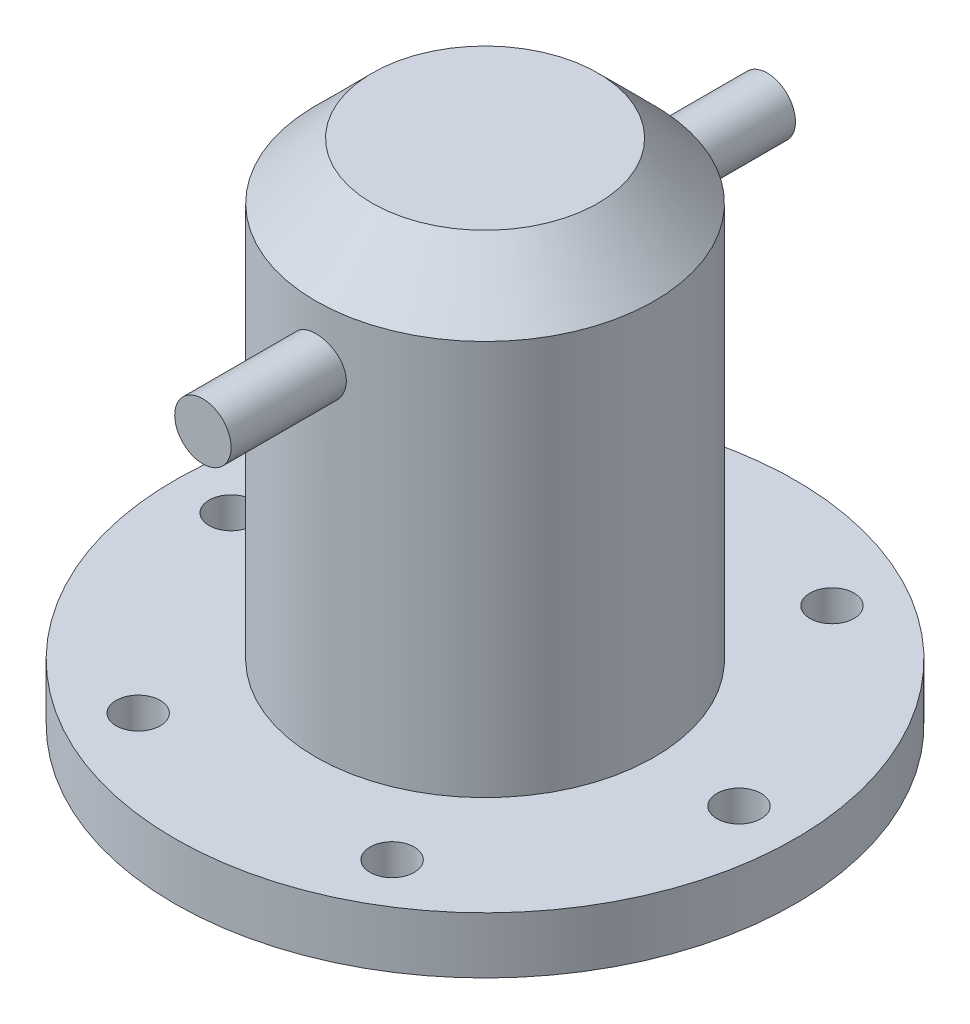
ISO-10303-21;
HEADER;
FILE_DESCRIPTION(('STEP AP214'),'2;1');
FILE_NAME('part.step','',(''),(''),'','','');
FILE_SCHEMA(('AUTOMOTIVE_DESIGN { 1 0 10303 214 1 1 1 1 }'));
ENDSEC;
DATA;
#1=APPLICATION_CONTEXT('core data for automotive mechanical design processes');
#2=APPLICATION_PROTOCOL_DEFINITION('international standard','automotive_design',2000,#1);
#3=PRODUCT_CONTEXT('',#1,'mechanical');
#4=PRODUCT('Part','Part','',(#3));
#5=PRODUCT_RELATED_PRODUCT_CATEGORY('part','',(#4));
#6=PRODUCT_DEFINITION_FORMATION('','',#4);
#7=PRODUCT_DEFINITION_CONTEXT('part definition',#1,'design');
#8=PRODUCT_DEFINITION('design','',#6,#7);
#9=PRODUCT_DEFINITION_SHAPE('','',#8);
#10=(LENGTH_UNIT() NAMED_UNIT(*) SI_UNIT(.MILLI.,.METRE.));
#11=(NAMED_UNIT(*) PLANE_ANGLE_UNIT() SI_UNIT($,.RADIAN.));
#12=(NAMED_UNIT(*) SI_UNIT($,.STERADIAN.) SOLID_ANGLE_UNIT());
#13=UNCERTAINTY_MEASURE_WITH_UNIT(LENGTH_MEASURE(1.E-05),#10,'distance_accuracy_value','');
#14=(GEOMETRIC_REPRESENTATION_CONTEXT(3) GLOBAL_UNCERTAINTY_ASSIGNED_CONTEXT((#13)) GLOBAL_UNIT_ASSIGNED_CONTEXT((#10,
#11,#12)) REPRESENTATION_CONTEXT('',''));
#15=CARTESIAN_POINT('',(0.,0.,0.));
#16=DIRECTION('',(0.,0.,1.));
#17=DIRECTION('',(1.,0.,0.));
#18=AXIS2_PLACEMENT_3D('',#15,#16,#17);
#19=CARTESIAN_POINT('',(0.,0.,0.));
#20=DIRECTION('',(0.,1.,0.));
#21=DIRECTION('',(0.,0.,1.));
#22=AXIS2_PLACEMENT_3D('',#19,#20,#21);
#23=CYLINDRICAL_SURFACE('',#22,38.1);
#24=CARTESIAN_POINT('',(-6.35,88.9,-37.5671066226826));
#25=CARTESIAN_POINT('',(-6.35000273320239,89.0770679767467,-37.5671053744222));
#26=CARTESIAN_POINT('',(-6.34259145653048,89.254099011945,-37.5683609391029));
#27=CARTESIAN_POINT('',(-6.31300769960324,89.6069429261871,-37.5733439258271));
#28=CARTESIAN_POINT('',(-6.29083229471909,89.7827555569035,-37.5770718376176));
#29=CARTESIAN_POINT('',(-6.2318672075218,90.1319541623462,-37.5868955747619));
#30=CARTESIAN_POINT('',(-6.19506827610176,90.3053385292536,-37.5929928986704));
#31=CARTESIAN_POINT('',(-6.10712272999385,90.6484047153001,-37.6073800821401));
#32=CARTESIAN_POINT('',(-6.05597084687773,90.8180851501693,-37.61567074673));
#33=CARTESIAN_POINT('',(-5.93978072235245,91.1522798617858,-37.6341926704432));
#34=CARTESIAN_POINT('',(-5.87475944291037,91.3168001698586,-37.6444215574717));
#35=CARTESIAN_POINT('',(-5.73124544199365,91.6398121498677,-37.6665381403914));
#36=CARTESIAN_POINT('',(-5.65274775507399,91.7983015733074,-37.6784264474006));
#37=CARTESIAN_POINT('',(-5.48290450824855,92.1080270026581,-37.7035160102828));
#38=CARTESIAN_POINT('',(-5.39156532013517,92.2592665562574,-37.7167166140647));
#39=CARTESIAN_POINT('',(-5.19661640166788,92.5536078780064,-37.7440706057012));
#40=CARTESIAN_POINT('',(-5.09300210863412,92.6967065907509,-37.7582243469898));
#41=CARTESIAN_POINT('',(-4.87331964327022,92.974915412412,-37.7872085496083));
#42=CARTESIAN_POINT('',(-4.75715354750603,93.109947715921,-37.8020437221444));
#43=CARTESIAN_POINT('',(-4.51385687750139,93.3698198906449,-37.8318664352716));
#44=CARTESIAN_POINT('',(-4.38672225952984,93.4946559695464,-37.846854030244));
#45=CARTESIAN_POINT('',(-4.1224382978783,93.733185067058,-37.8765517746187));
#46=CARTESIAN_POINT('',(-3.985292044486,93.8468814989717,-37.8912620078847));
#47=CARTESIAN_POINT('',(-3.7018362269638,94.0624240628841,-37.9200040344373));
#48=CARTESIAN_POINT('',(-3.55552330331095,94.1642658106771,-37.9340355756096));
#49=CARTESIAN_POINT('',(-3.25393610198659,94.3558677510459,-37.9610977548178));
#50=CARTESIAN_POINT('',(-3.09861610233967,94.4455568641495,-37.9741223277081));
#51=CARTESIAN_POINT('',(-2.78079967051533,94.6115506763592,-37.9987180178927));
#52=CARTESIAN_POINT('',(-2.61830058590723,94.6878503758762,-38.0102885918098));
#53=CARTESIAN_POINT('',(-2.28738093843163,94.826426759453,-38.0316359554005));
#54=CARTESIAN_POINT('',(-2.11896289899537,94.8887093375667,-38.0414134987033));
#55=CARTESIAN_POINT('',(-1.77734849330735,94.9988362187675,-38.0589068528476));
#56=CARTESIAN_POINT('',(-1.60415040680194,95.0466752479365,-38.0666219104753));
#57=CARTESIAN_POINT('',(-1.08260706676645,95.16710833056,-38.0861859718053));
#58=CARTESIAN_POINT('',(-0.728853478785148,95.2180612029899,-38.0946836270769));
#59=CARTESIAN_POINT('',(-0.0179171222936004,95.2599644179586,-38.101657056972));
#60=CARTESIAN_POINT('',(0.339265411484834,95.2509188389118,-38.1001335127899));
#61=CARTESIAN_POINT('',(1.04342326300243,95.173588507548,-38.0873207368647));
#62=CARTESIAN_POINT('',(1.39046463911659,95.1058913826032,-38.0761283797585));
#63=CARTESIAN_POINT('',(2.06817845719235,94.914083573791,-38.0453389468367));
#64=CARTESIAN_POINT('',(2.39885040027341,94.7899711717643,-38.0257416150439));
#65=CARTESIAN_POINT('',(3.03620358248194,94.4882774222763,-37.9801804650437));
#66=CARTESIAN_POINT('',(3.34276805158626,94.3104538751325,-37.9541879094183));
#67=CARTESIAN_POINT('',(3.92192672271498,93.9065615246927,-37.8987237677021));
#68=CARTESIAN_POINT('',(4.19451817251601,93.6804888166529,-37.8692519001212));
#69=CARTESIAN_POINT('',(4.70146695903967,93.1832558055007,-37.8096848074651));
#70=CARTESIAN_POINT('',(4.93532031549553,92.911581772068,-37.7795863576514));
#71=CARTESIAN_POINT('',(5.35420467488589,92.3325887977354,-37.7225041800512));
#72=CARTESIAN_POINT('',(5.53923522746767,92.0252695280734,-37.6955204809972));
#73=CARTESIAN_POINT('',(5.85532085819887,91.3831252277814,-37.6477213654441));
#74=CARTESIAN_POINT('',(5.98631524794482,91.0482697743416,-37.6269128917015));
#75=CARTESIAN_POINT('',(6.190055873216,90.3608833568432,-37.5939351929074));
#76=CARTESIAN_POINT('',(6.26280723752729,90.0083539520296,-37.5817652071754));
#77=CARTESIAN_POINT('',(6.34728698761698,89.3001359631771,-37.5675895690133));
#78=CARTESIAN_POINT('',(6.35973380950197,88.9445353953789,-37.5654642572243));
#79=CARTESIAN_POINT('',(6.32516566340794,88.2363318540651,-37.5712998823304));
#80=CARTESIAN_POINT('',(6.27815299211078,87.8837287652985,-37.5792604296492));
#81=CARTESIAN_POINT('',(6.12661293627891,87.1938114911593,-37.604260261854));
#82=CARTESIAN_POINT('',(6.02245124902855,86.8564147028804,-37.6212417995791));
#83=CARTESIAN_POINT('',(5.7599533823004,86.2038657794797,-37.6623217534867));
#84=CARTESIAN_POINT('',(5.60161396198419,85.8887149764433,-37.6864205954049));
#85=CARTESIAN_POINT('',(5.23356002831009,85.286406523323,-37.7392978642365));
#86=CARTESIAN_POINT('',(5.02338512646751,84.9995338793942,-37.7681174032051));
#87=CARTESIAN_POINT('',(4.5582569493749,84.4648716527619,-37.8270685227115));
#88=CARTESIAN_POINT('',(4.30330052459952,84.2170848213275,-37.8572001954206));
#89=CARTESIAN_POINT('',(3.75266840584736,83.7650040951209,-37.9157591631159));
#90=CARTESIAN_POINT('',(3.45659681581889,83.5611893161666,-37.9441654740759));
#91=CARTESIAN_POINT('',(2.83398420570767,83.2061958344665,-37.9957357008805));
#92=CARTESIAN_POINT('',(2.5074441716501,83.0550154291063,-38.018899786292));
#93=CARTESIAN_POINT('',(1.83465502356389,82.8103217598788,-38.0572868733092));
#94=CARTESIAN_POINT('',(1.48849890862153,82.71655779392,-38.0725443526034));
#95=CARTESIAN_POINT('',(0.784880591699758,82.5885734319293,-38.0935356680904));
#96=CARTESIAN_POINT('',(0.427419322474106,82.5543481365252,-38.0992702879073));
#97=CARTESIAN_POINT('',(-0.106745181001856,82.548426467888,-38.1002647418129));
#98=CARTESIAN_POINT('',(-0.283476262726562,82.5538668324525,-38.0993542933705));
#99=CARTESIAN_POINT('',(-0.635823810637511,82.5794490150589,-38.0951001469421));
#100=CARTESIAN_POINT('',(-0.811440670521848,82.5995853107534,-38.0917573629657));
#101=CARTESIAN_POINT('',(-1.16037482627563,82.6544215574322,-38.0827261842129));
#102=CARTESIAN_POINT('',(-1.3336912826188,82.6891266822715,-38.077036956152));
#103=CARTESIAN_POINT('',(-1.67668986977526,82.7728181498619,-38.0634752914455));
#104=CARTESIAN_POINT('',(-1.84637328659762,82.8217993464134,-38.0556036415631));
#105=CARTESIAN_POINT('',(-2.18085097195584,82.9336390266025,-38.0379011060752));
#106=CARTESIAN_POINT('',(-2.34564888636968,82.9964868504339,-38.0280717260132));
#107=CARTESIAN_POINT('',(-2.66929808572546,83.1355953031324,-38.0067249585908));
#108=CARTESIAN_POINT('',(-2.82815147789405,83.2118511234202,-37.9952081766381));
#109=CARTESIAN_POINT('',(-3.13895355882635,83.3772765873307,-37.9707951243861));
#110=CARTESIAN_POINT('',(-3.29089952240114,83.4664512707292,-37.9578983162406));
#111=CARTESIAN_POINT('',(-3.58674415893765,83.6570316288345,-37.9310865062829));
#112=CARTESIAN_POINT('',(-3.73064563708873,83.7584330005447,-37.9171718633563));
#113=CARTESIAN_POINT('',(-4.01114809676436,83.974063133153,-37.8885313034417));
#114=CARTESIAN_POINT('',(-4.14764257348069,84.0884294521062,-37.8737977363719));
#115=CARTESIAN_POINT('',(-4.41048688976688,84.328158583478,-37.8440893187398));
#116=CARTESIAN_POINT('',(-4.53684033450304,84.4535174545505,-37.8291145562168));
#117=CARTESIAN_POINT('',(-4.77866436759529,84.7144855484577,-37.7993283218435));
#118=CARTESIAN_POINT('',(-4.8941283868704,84.8501008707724,-37.784516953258));
#119=CARTESIAN_POINT('',(-5.11324724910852,85.1305364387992,-37.7554885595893));
#120=CARTESIAN_POINT('',(-5.21690643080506,85.2753532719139,-37.7412713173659));
#121=CARTESIAN_POINT('',(-5.41246463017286,85.5743609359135,-37.7137250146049));
#122=CARTESIAN_POINT('',(-5.50427005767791,85.7286136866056,-37.700403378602));
#123=CARTESIAN_POINT('',(-5.67450568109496,86.0443660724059,-37.6751561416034));
#124=CARTESIAN_POINT('',(-5.75294079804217,86.2058630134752,-37.6632300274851));
#125=CARTESIAN_POINT('',(-5.89584528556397,86.5349094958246,-37.6411243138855));
#126=CARTESIAN_POINT('',(-5.96032438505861,86.7024547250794,-37.63094349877));
#127=CARTESIAN_POINT('',(-6.07488155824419,87.0424475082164,-37.6126198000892));
#128=CARTESIAN_POINT('',(-6.12496272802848,87.2148939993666,-37.6044764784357));
#129=CARTESIAN_POINT('',(-6.22810526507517,87.6359970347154,-37.5875581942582));
#130=CARTESIAN_POINT('',(-6.27376135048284,87.8865519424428,-37.5799262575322));
#131=CARTESIAN_POINT('',(-6.33470648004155,88.3914300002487,-37.5697014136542));
#132=CARTESIAN_POINT('',(-6.3499960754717,88.6457530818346,-37.5671084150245));
#133=CARTESIAN_POINT('',(-6.35,88.9,-37.5671066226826));
#134=B_SPLINE_CURVE_WITH_KNOTS('',3,(#24,#25,#26,#27,#28,#29,#30,#31,#32,#33,#34,#35,#36,#37,
#38,#39,#40,#41,#42,#43,#44,#45,#46,#47,#48,#49,#50,#51,#52,#53,#54,#55,#56,#57,#58,#59,#60,#61,
#62,#63,#64,#65,#66,#67,#68,#69,#70,#71,#72,#73,#74,#75,#76,#77,#78,#79,#80,#81,#82,#83,#84,#85,
#86,#87,#88,#89,#90,#91,#92,#93,#94,#95,#96,#97,#98,#99,#100,#101,#102,#103,#104,#105,#106,#107,
#108,#109,#110,#111,#112,#113,#114,#115,#116,#117,#118,#119,#120,#121,#122,#123,#124,#125,#126,
#127,#128,#129,#130,#131,#132,#133),.UNSPECIFIED.,.T.,.F.,(4,2,2,2,2,2,2,2,2,2,2,2,2,2,2,2,2,2,
2,2,2,2,2,2,2,2,2,2,2,2,2,2,2,2,2,2,2,2,2,2,2,2,2,2,2,2,2,2,2,2,2,2,2,2,4),(0.,
0.530980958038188,1.0620671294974,1.59348973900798,2.12510766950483,2.65607913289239,
3.18724665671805,3.71815154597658,4.2492543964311,4.78484935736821,5.32064262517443,
5.85627120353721,6.39209724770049,6.930933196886,7.46996992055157,8.00877955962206,
8.54778570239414,9.61467796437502,10.6814977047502,11.7377510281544,12.79403652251,
13.8551580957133,14.9163655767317,15.9904476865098,17.0645397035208,18.1398347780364,
19.215035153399,20.2773941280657,21.3397120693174,22.3953101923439,23.4509714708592,
24.516369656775,25.5818428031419,26.6583966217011,27.7349156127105,28.8066999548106,
29.8783960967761,30.408331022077,30.9380669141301,31.4679910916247,31.9977244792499,
32.5270520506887,33.0561901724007,33.5855352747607,34.11469462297,34.6501139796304,
35.1853421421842,35.720891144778,36.2562426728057,36.7955915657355,37.3347415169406,
37.8735144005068,38.4121713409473,39.1746057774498,39.9370263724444),.UNSPECIFIED.);
#135=CARTESIAN_POINT('',(-6.35,88.9,-37.5671066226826));
#136=VERTEX_POINT('',#135);
#137=EDGE_CURVE('E40',#136,#136,#134,.T.);
#138=ORIENTED_EDGE('',*,*,#137,.F.);
#139=EDGE_LOOP('',(#138));
#140=FACE_BOUND('',#139,.T.);
#141=CARTESIAN_POINT('',(0.,101.6,0.));
#142=DIRECTION('',(0.,1.,0.));
#143=DIRECTION('',(0.,0.,1.));
#144=AXIS2_PLACEMENT_3D('',#141,#142,#143);
#145=CIRCLE('',#144,38.1);
#146=CARTESIAN_POINT('',(0.,101.6,38.1));
#147=VERTEX_POINT('',#146);
#148=EDGE_CURVE('E93',#147,#147,#145,.T.);
#149=ORIENTED_EDGE('',*,*,#148,.F.);
#150=EDGE_LOOP('',(#149));
#151=FACE_BOUND('',#150,.T.);
#152=CARTESIAN_POINT('',(0.,12.7,0.));
#153=DIRECTION('',(0.,1.,0.));
#154=DIRECTION('',(0.,0.,1.));
#155=AXIS2_PLACEMENT_3D('',#152,#153,#154);
#156=CIRCLE('',#155,38.1);
#157=CARTESIAN_POINT('',(0.,12.7,38.1));
#158=VERTEX_POINT('',#157);
#159=EDGE_CURVE('E97',#158,#158,#156,.T.);
#160=ORIENTED_EDGE('',*,*,#159,.T.);
#161=EDGE_LOOP('',(#160));
#162=FACE_BOUND('',#161,.T.);
#163=CARTESIAN_POINT('',(0.,82.55,38.1));
#164=CARTESIAN_POINT('',(0.177087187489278,82.5499972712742,38.1000011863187));
#165=CARTESIAN_POINT('',(0.354137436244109,82.5574101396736,38.0987630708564));
#166=CARTESIAN_POINT('',(0.707020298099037,82.5870004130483,38.0938477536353));
#167=CARTESIAN_POINT('',(0.882852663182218,82.6091807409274,38.0901700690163));
#168=CARTESIAN_POINT('',(1.23209116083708,82.6681592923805,38.0804739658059));
#169=CARTESIAN_POINT('',(1.4054956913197,82.704966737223,38.0744540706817));
#170=CARTESIAN_POINT('',(1.74860263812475,82.7929332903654,38.0602401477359));
#171=CARTESIAN_POINT('',(1.91830367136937,82.8440976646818,38.0520453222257));
#172=CARTESIAN_POINT('',(2.2525422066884,82.9603179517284,38.0337223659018));
#173=CARTESIAN_POINT('',(2.41708564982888,83.0253571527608,38.0235965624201));
#174=CARTESIAN_POINT('',(2.74014193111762,83.168911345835,38.0016821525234));
#175=CARTESIAN_POINT('',(2.89865252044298,83.2474313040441,37.98989293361));
#176=CARTESIAN_POINT('',(3.20841653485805,83.4173225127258,37.9649864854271));
#177=CARTESIAN_POINT('',(3.35967352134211,83.5086873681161,37.9518699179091));
#178=CARTESIAN_POINT('',(3.65404496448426,83.703689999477,37.9246597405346));
#179=CARTESIAN_POINT('',(3.79715636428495,83.8073323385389,37.9105657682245));
#180=CARTESIAN_POINT('',(4.07534808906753,84.0270429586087,37.8816744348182));
#181=CARTESIAN_POINT('',(4.21035302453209,84.1432060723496,37.8668722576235));
#182=CARTESIAN_POINT('',(4.47017019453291,84.3864909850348,37.8370808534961));
#183=CARTESIAN_POINT('',(4.59497863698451,84.513616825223,37.822091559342));
#184=CARTESIAN_POINT('',(4.83345363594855,84.7778777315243,37.7923559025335));
#185=CARTESIAN_POINT('',(4.94712356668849,84.9150097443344,37.7776094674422));
#186=CARTESIAN_POINT('',(5.16261513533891,85.1984316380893,37.7487646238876));
#187=CARTESIAN_POINT('',(5.26443238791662,85.3447248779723,37.7346664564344));
#188=CARTESIAN_POINT('',(5.45600638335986,85.6462962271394,37.7074450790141));
#189=CARTESIAN_POINT('',(5.54568970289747,85.8016215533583,37.6943280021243));
#190=CARTESIAN_POINT('',(5.71167137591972,86.1194481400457,37.6695348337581));
#191=CARTESIAN_POINT('',(5.78796472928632,86.2819520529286,37.6578592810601));
#192=CARTESIAN_POINT('',(5.92652810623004,86.6128815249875,37.6363015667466));
#193=CARTESIAN_POINT('',(5.98880405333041,86.7813045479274,37.6264186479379));
#194=CARTESIAN_POINT('',(6.09891747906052,87.1229300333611,37.6087259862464));
#195=CARTESIAN_POINT('',(6.14674968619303,87.2961342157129,37.600917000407));
#196=CARTESIAN_POINT('',(6.26716384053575,87.8177078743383,37.581106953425));
#197=CARTESIAN_POINT('',(6.31810213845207,88.1714884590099,37.5724910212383));
#198=CARTESIAN_POINT('',(6.35996687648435,88.8824780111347,37.5654259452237));
#199=CARTESIAN_POINT('',(6.35089756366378,89.239686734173,37.5669760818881));
#200=CARTESIAN_POINT('',(6.27352869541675,89.9437424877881,37.5799723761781));
#201=CARTESIAN_POINT('',(6.20584069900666,90.2906583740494,37.5913163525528));
#202=CARTESIAN_POINT('',(6.01409427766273,90.9681259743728,37.6224668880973));
#203=CARTESIAN_POINT('',(5.89003391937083,91.2986771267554,37.6422737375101));
#204=CARTESIAN_POINT('',(5.58844985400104,91.9358801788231,37.6882274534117));
#205=CARTESIAN_POINT('',(5.41067212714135,92.2424096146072,37.7144043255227));
#206=CARTESIAN_POINT('',(5.0068786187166,92.8215174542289,37.7701281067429));
#207=CARTESIAN_POINT('',(4.78085894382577,93.0940931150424,37.7996752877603));
#208=CARTESIAN_POINT('',(4.28366479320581,93.6010981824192,37.8592595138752));
#209=CARTESIAN_POINT('',(4.01196546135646,93.83501301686,37.8892980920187));
#210=CARTESIAN_POINT('',(3.43289953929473,94.2540095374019,37.946142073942));
#211=CARTESIAN_POINT('',(3.12553271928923,94.4390909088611,37.9729474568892));
#212=CARTESIAN_POINT('',(2.48337302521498,94.7552136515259,38.0203428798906));
#213=CARTESIAN_POINT('',(2.14855736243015,94.8862095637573,38.0409276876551));
#214=CARTESIAN_POINT('',(1.46125779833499,95.0899653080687,38.0735205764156));
#215=CARTESIAN_POINT('',(1.10877537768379,95.1627300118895,38.0855293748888));
#216=CARTESIAN_POINT('',(0.400583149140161,95.2472602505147,38.0995206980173));
#217=CARTESIAN_POINT('',(0.0449598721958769,95.259732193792,38.1016193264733));
#218=CARTESIAN_POINT('',(-0.66329502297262,95.2252061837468,38.0958718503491));
#219=CARTESIAN_POINT('',(-1.01592675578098,95.1782105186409,38.0880261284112));
#220=CARTESIAN_POINT('',(-1.70600668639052,95.0266708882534,38.063343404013));
#221=CARTESIAN_POINT('',(-2.04353380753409,94.9224766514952,38.0465610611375));
#222=CARTESIAN_POINT('',(-2.69632908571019,94.6598703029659,38.0058793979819));
#223=CARTESIAN_POINT('',(-3.01159599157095,94.5014551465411,37.9819796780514));
#224=CARTESIAN_POINT('',(-3.61398995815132,94.1332862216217,37.9294267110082));
#225=CARTESIAN_POINT('',(-3.90084376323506,93.9230911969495,37.9007333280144));
#226=CARTESIAN_POINT('',(-4.43545868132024,93.4579349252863,37.841897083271));
#227=CARTESIAN_POINT('',(-4.68321695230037,93.2029704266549,37.8117541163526));
#228=CARTESIAN_POINT('',(-5.13522675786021,92.6523493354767,37.7530404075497));
#229=CARTESIAN_POINT('',(-5.33900101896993,92.356298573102,37.7244891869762));
#230=CARTESIAN_POINT('',(-5.69392350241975,91.7337393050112,37.6725570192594));
#231=CARTESIAN_POINT('',(-5.8450733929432,91.4072317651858,37.6491759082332));
#232=CARTESIAN_POINT('',(-6.08974872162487,90.7344295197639,37.6103751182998));
#233=CARTESIAN_POINT('',(-6.18351170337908,90.388222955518,37.5949226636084));
#234=CARTESIAN_POINT('',(-6.31147698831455,89.6844973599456,37.5736562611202));
#235=CARTESIAN_POINT('',(-6.34568446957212,89.3269793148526,37.5678414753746));
#236=CARTESIAN_POINT('',(-6.35156479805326,88.7927995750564,37.566839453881));
#237=CARTESIAN_POINT('',(-6.3461134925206,88.6161081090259,37.5677648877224));
#238=CARTESIAN_POINT('',(-6.32051614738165,88.263841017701,37.5720813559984));
#239=CARTESIAN_POINT('',(-6.30037562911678,88.0882649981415,37.5754714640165));
#240=CARTESIAN_POINT('',(-6.24553793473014,87.7394133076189,37.5846246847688));
#241=CARTESIAN_POINT('',(-6.21083556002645,87.5661384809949,37.5903886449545));
#242=CARTESIAN_POINT('',(-6.1271569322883,87.2232235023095,37.604118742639));
#243=CARTESIAN_POINT('',(-6.0781858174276,87.0535820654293,37.6120840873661));
#244=CARTESIAN_POINT('',(-5.96637654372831,86.7191958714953,37.6299820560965));
#245=CARTESIAN_POINT('',(-5.90354973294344,86.5544472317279,37.6399130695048));
#246=CARTESIAN_POINT('',(-5.76449173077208,86.2308934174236,37.6614601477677));
#247=CARTESIAN_POINT('',(-5.68826534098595,86.072086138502,37.6730756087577));
#248=CARTESIAN_POINT('',(-5.5229061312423,85.7613709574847,37.6976722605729));
#249=CARTESIAN_POINT('',(-5.43376825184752,85.6094657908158,37.7106539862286));
#250=CARTESIAN_POINT('',(-5.24326758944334,85.3136958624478,37.7376124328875));
#251=CARTESIAN_POINT('',(-5.14190910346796,85.1698283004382,37.7515888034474));
#252=CARTESIAN_POINT('',(-4.92632600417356,84.8893289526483,37.7803292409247));
#253=CARTESIAN_POINT('',(-4.81195911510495,84.7528072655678,37.7951008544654));
#254=CARTESIAN_POINT('',(-4.57222320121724,84.4899079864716,37.824851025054));
#255=CARTESIAN_POINT('',(-4.44685811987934,84.3635267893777,37.8398295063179));
#256=CARTESIAN_POINT('',(-4.18587205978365,84.1216479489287,37.869588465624));
#257=CARTESIAN_POINT('',(-4.05024500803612,84.0061568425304,37.8843688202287));
#258=CARTESIAN_POINT('',(-3.76978048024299,83.7869854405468,37.9133039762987));
#259=CARTESIAN_POINT('',(-3.62494642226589,83.6833008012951,37.9274590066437));
#260=CARTESIAN_POINT('',(-3.32592456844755,83.4877108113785,37.9548537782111));
#261=CARTESIAN_POINT('',(-3.17167621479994,83.395896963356,37.9680860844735));
#262=CARTESIAN_POINT('',(-2.85593164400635,83.2256441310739,37.9931404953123));
#263=CARTESIAN_POINT('',(-2.69443812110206,83.147200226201,38.0049631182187));
#264=CARTESIAN_POINT('',(-2.36539813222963,83.0042781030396,38.026859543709));
#265=CARTESIAN_POINT('',(-2.19785596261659,82.9397901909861,38.0369345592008));
#266=CARTESIAN_POINT('',(-1.85787010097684,82.8252155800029,38.05505638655));
#267=CARTESIAN_POINT('',(-1.68542746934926,82.7751257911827,38.0631036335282));
#268=CARTESIAN_POINT('',(-1.26427501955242,82.671947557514,38.0798175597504));
#269=CARTESIAN_POINT('',(-1.01366559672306,82.6262715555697,38.0873506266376));
#270=CARTESIAN_POINT('',(-0.508678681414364,82.5652999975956,38.0974409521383));
#271=CARTESIAN_POINT('',(-0.254301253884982,82.5500039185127,38.0999982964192));
#272=CARTESIAN_POINT('',(0.,82.55,38.1));
#273=B_SPLINE_CURVE_WITH_KNOTS('',3,(#163,#164,#165,#166,#167,#168,#169,#170,#171,#172,#173,
#174,#175,#176,#177,#178,#179,#180,#181,#182,#183,#184,#185,#186,#187,#188,#189,#190,#191,#192,
#193,#194,#195,#196,#197,#198,#199,#200,#201,#202,#203,#204,#205,#206,#207,#208,#209,#210,#211,
#212,#213,#214,#215,#216,#217,#218,#219,#220,#221,#222,#223,#224,#225,#226,#227,#228,#229,#230,
#231,#232,#233,#234,#235,#236,#237,#238,#239,#240,#241,#242,#243,#244,#245,#246,#247,#248,#249,
#250,#251,#252,#253,#254,#255,#256,#257,#258,#259,#260,#261,#262,#263,#264,#265,#266,#267,#268,
#269,#270,#271,#272),.UNSPECIFIED.,.T.,.F.,(4,2,2,2,2,2,2,2,2,2,2,2,2,2,2,2,2,2,2,2,2,2,2,2,2,2,
2,2,2,2,2,2,2,2,2,2,2,2,2,2,2,2,2,2,2,2,2,2,2,2,2,2,2,2,4),(0.,0.531038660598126,
1.06218246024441,1.59366163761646,2.12533601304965,2.6563735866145,3.1876072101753,
3.71857727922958,4.24974531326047,4.78526441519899,5.32098177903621,5.85653635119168,
6.39228844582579,6.93114981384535,7.47021197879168,8.00904591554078,8.5480762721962,
9.61504645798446,10.6819411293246,11.7378373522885,12.7937697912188,13.8547758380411,
14.9158675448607,15.9901084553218,17.0643562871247,18.1395051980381,19.2145641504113,
20.2769963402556,21.339387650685,22.3953543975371,23.4513804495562,24.5167374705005,
25.5821719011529,26.6586431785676,27.7350803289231,28.807031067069,29.8788885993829,
30.4087059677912,30.9383242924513,31.4681318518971,31.9977488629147,32.5269337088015,
33.0559293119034,33.5851327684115,34.1141506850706,34.6496427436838,35.1849435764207,
35.720563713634,36.2559861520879,36.795316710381,37.3344483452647,37.8732042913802,
38.411844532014,39.1744413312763,39.9370250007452),.UNSPECIFIED.);
#274=CARTESIAN_POINT('',(0.,82.55,38.1));
#275=VERTEX_POINT('',#274);
#276=EDGE_CURVE('E10',#275,#275,#273,.T.);
#277=ORIENTED_EDGE('',*,*,#276,.F.);
#278=EDGE_LOOP('',(#277));
#279=FACE_BOUND('',#278,.T.);
#280=ADVANCED_FACE('F29',(#140,#151,#162,#279),#23,.T.);
#281=CARTESIAN_POINT('',(69.85,0.,0.));
#282=DIRECTION('',(0.,1.,0.));
#283=DIRECTION('',(0.,0.,1.));
#284=AXIS2_PLACEMENT_3D('',#281,#282,#283);
#285=PLANE('',#284);
#286=CARTESIAN_POINT('',(28.5750000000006,0.,-49.4933518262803));
#287=DIRECTION('',(0.,1.,0.));
#288=DIRECTION('',(0.866025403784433,0.,0.50000000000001));
#289=AXIS2_PLACEMENT_3D('',#286,#287,#288);
#290=CIRCLE('',#289,4.96570000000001);
#291=CARTESIAN_POINT('',(32.8754223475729,0.,-47.0105018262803));
#292=VERTEX_POINT('',#291);
#293=EDGE_CURVE('E142',#292,#292,#290,.T.);
#294=ORIENTED_EDGE('',*,*,#293,.T.);
#295=EDGE_LOOP('',(#294));
#296=FACE_BOUND('',#295,.T.);
#297=CARTESIAN_POINT('',(-28.5749999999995,0.,-49.4933518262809));
#298=DIRECTION('',(0.,1.,0.));
#299=DIRECTION('',(0.866025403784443,0.,-0.499999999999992));
#300=AXIS2_PLACEMENT_3D('',#297,#298,#299);
#301=CIRCLE('',#300,4.96570000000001);
#302=CARTESIAN_POINT('',(-24.2745776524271,0.,-51.9762018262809));
#303=VERTEX_POINT('',#302);
#304=EDGE_CURVE('E136',#303,#303,#301,.T.);
#305=ORIENTED_EDGE('',*,*,#304,.T.);
#306=EDGE_LOOP('',(#305));
#307=FACE_BOUND('',#306,.T.);
#308=CARTESIAN_POINT('',(-57.15,0.,-3.99076548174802E-13));
#309=DIRECTION('',(0.,1.,0.));
#310=DIRECTION('',(0.,0.,-1.));
#311=AXIS2_PLACEMENT_3D('',#308,#309,#310);
#312=CIRCLE('',#311,4.96570000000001);
#313=CARTESIAN_POINT('',(-57.15,0.,-4.96570000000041));
#314=VERTEX_POINT('',#313);
#315=EDGE_CURVE('E130',#314,#314,#312,.T.);
#316=ORIENTED_EDGE('',*,*,#315,.T.);
#317=EDGE_LOOP('',(#316));
#318=FACE_BOUND('',#317,.T.);
#319=CARTESIAN_POINT('',(-28.5750000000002,0.,49.4933518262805));
#320=DIRECTION('',(0.,1.,0.));
#321=DIRECTION('',(-0.866025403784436,0.,-0.500000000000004));
#322=AXIS2_PLACEMENT_3D('',#319,#320,#321);
#323=CIRCLE('',#322,4.96570000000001);
#324=CARTESIAN_POINT('',(-32.8754223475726,0.,47.0105018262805));
#325=VERTEX_POINT('',#324);
#326=EDGE_CURVE('E124',#325,#325,#323,.T.);
#327=ORIENTED_EDGE('',*,*,#326,.T.);
#328=EDGE_LOOP('',(#327));
#329=FACE_BOUND('',#328,.T.);
#330=CARTESIAN_POINT('',(28.5749999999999,0.,49.4933518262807));
#331=DIRECTION('',(0.,1.,0.));
#332=DIRECTION('',(-0.86602540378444,0.,0.499999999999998));
#333=AXIS2_PLACEMENT_3D('',#330,#331,#332);
#334=CIRCLE('',#333,4.96570000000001);
#335=CARTESIAN_POINT('',(24.2745776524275,0.,51.9762018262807));
#336=VERTEX_POINT('',#335);
#337=EDGE_CURVE('E118',#336,#336,#334,.T.);
#338=ORIENTED_EDGE('',*,*,#337,.T.);
#339=EDGE_LOOP('',(#338));
#340=FACE_BOUND('',#339,.T.);
#341=CARTESIAN_POINT('',(57.15,0.,0.));
#342=DIRECTION('',(0.,1.,0.));
#343=DIRECTION('',(0.,0.,1.));
#344=AXIS2_PLACEMENT_3D('',#341,#342,#343);
#345=CIRCLE('',#344,4.96570000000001);
#346=CARTESIAN_POINT('',(57.15,0.,4.96570000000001));
#347=VERTEX_POINT('',#346);
#348=EDGE_CURVE('E112',#347,#347,#345,.T.);
#349=ORIENTED_EDGE('',*,*,#348,.T.);
#350=EDGE_LOOP('',(#349));
#351=FACE_BOUND('',#350,.T.);
#352=CARTESIAN_POINT('',(0.,0.,0.));
#353=DIRECTION('',(0.,1.,0.));
#354=DIRECTION('',(0.,0.,1.));
#355=AXIS2_PLACEMENT_3D('',#352,#353,#354);
#356=CIRCLE('',#355,69.85);
#357=CARTESIAN_POINT('',(0.,0.,69.85));
#358=VERTEX_POINT('',#357);
#359=EDGE_CURVE('E44',#358,#358,#356,.T.);
#360=ORIENTED_EDGE('',*,*,#359,.F.);
#361=EDGE_LOOP('',(#360));
#362=FACE_BOUND('',#361,.T.);
#363=ADVANCED_FACE('F31',(#296,#307,#318,#329,#340,#351,#362),#285,.F.);
#364=CARTESIAN_POINT('',(0.,0.,0.));
#365=DIRECTION('',(0.,1.,0.));
#366=DIRECTION('',(0.,0.,1.));
#367=AXIS2_PLACEMENT_3D('',#364,#365,#366);
#368=CYLINDRICAL_SURFACE('',#367,69.85);
#369=CARTESIAN_POINT('',(0.,12.7,0.));
#370=DIRECTION('',(0.,1.,0.));
#371=DIRECTION('',(0.,0.,1.));
#372=AXIS2_PLACEMENT_3D('',#369,#370,#371);
#373=CIRCLE('',#372,69.85);
#374=CARTESIAN_POINT('',(0.,12.7,69.85));
#375=VERTEX_POINT('',#374);
#376=EDGE_CURVE('E48',#375,#375,#373,.T.);
#377=ORIENTED_EDGE('',*,*,#376,.F.);
#378=EDGE_LOOP('',(#377));
#379=FACE_BOUND('',#378,.T.);
#380=ORIENTED_EDGE('',*,*,#359,.T.);
#381=EDGE_LOOP('',(#380));
#382=FACE_BOUND('',#381,.T.);
#383=ADVANCED_FACE('F78',(#379,#382),#368,.T.);
#384=CARTESIAN_POINT('',(38.1,12.7,0.));
#385=DIRECTION('',(0.,-1.,0.));
#386=DIRECTION('',(0.,0.,-1.));
#387=AXIS2_PLACEMENT_3D('',#384,#385,#386);
#388=PLANE('',#387);
#389=CARTESIAN_POINT('',(28.5750000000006,12.7,-49.4933518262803));
#390=DIRECTION('',(0.,1.,0.));
#391=DIRECTION('',(0.866025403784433,0.,0.50000000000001));
#392=AXIS2_PLACEMENT_3D('',#389,#390,#391);
#393=CIRCLE('',#392,4.96570000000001);
#394=CARTESIAN_POINT('',(32.8754223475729,12.7,-47.0105018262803));
#395=VERTEX_POINT('',#394);
#396=EDGE_CURVE('E145',#395,#395,#393,.T.);
#397=ORIENTED_EDGE('',*,*,#396,.F.);
#398=EDGE_LOOP('',(#397));
#399=FACE_BOUND('',#398,.T.);
#400=CARTESIAN_POINT('',(-28.5749999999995,12.7,-49.4933518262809));
#401=DIRECTION('',(0.,1.,0.));
#402=DIRECTION('',(0.866025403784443,0.,-0.499999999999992));
#403=AXIS2_PLACEMENT_3D('',#400,#401,#402);
#404=CIRCLE('',#403,4.96570000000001);
#405=CARTESIAN_POINT('',(-24.2745776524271,12.7,-51.9762018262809));
#406=VERTEX_POINT('',#405);
#407=EDGE_CURVE('E139',#406,#406,#404,.T.);
#408=ORIENTED_EDGE('',*,*,#407,.F.);
#409=EDGE_LOOP('',(#408));
#410=FACE_BOUND('',#409,.T.);
#411=CARTESIAN_POINT('',(-57.15,12.7,-3.99076548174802E-13));
#412=DIRECTION('',(0.,1.,0.));
#413=DIRECTION('',(0.,0.,-1.));
#414=AXIS2_PLACEMENT_3D('',#411,#412,#413);
#415=CIRCLE('',#414,4.96570000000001);
#416=CARTESIAN_POINT('',(-57.15,12.7,-4.96570000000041));
#417=VERTEX_POINT('',#416);
#418=EDGE_CURVE('E133',#417,#417,#415,.T.);
#419=ORIENTED_EDGE('',*,*,#418,.F.);
#420=EDGE_LOOP('',(#419));
#421=FACE_BOUND('',#420,.T.);
#422=CARTESIAN_POINT('',(-28.5750000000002,12.7,49.4933518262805));
#423=DIRECTION('',(0.,1.,0.));
#424=DIRECTION('',(-0.866025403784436,0.,-0.500000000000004));
#425=AXIS2_PLACEMENT_3D('',#422,#423,#424);
#426=CIRCLE('',#425,4.96570000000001);
#427=CARTESIAN_POINT('',(-32.8754223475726,12.7,47.0105018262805));
#428=VERTEX_POINT('',#427);
#429=EDGE_CURVE('E127',#428,#428,#426,.T.);
#430=ORIENTED_EDGE('',*,*,#429,.F.);
#431=EDGE_LOOP('',(#430));
#432=FACE_BOUND('',#431,.T.);
#433=CARTESIAN_POINT('',(28.5749999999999,12.7,49.4933518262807));
#434=DIRECTION('',(0.,1.,0.));
#435=DIRECTION('',(-0.86602540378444,0.,0.499999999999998));
#436=AXIS2_PLACEMENT_3D('',#433,#434,#435);
#437=CIRCLE('',#436,4.96570000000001);
#438=CARTESIAN_POINT('',(24.2745776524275,12.7,51.9762018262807));
#439=VERTEX_POINT('',#438);
#440=EDGE_CURVE('E121',#439,#439,#437,.T.);
#441=ORIENTED_EDGE('',*,*,#440,.F.);
#442=EDGE_LOOP('',(#441));
#443=FACE_BOUND('',#442,.T.);
#444=CARTESIAN_POINT('',(57.15,12.7,0.));
#445=DIRECTION('',(0.,1.,0.));
#446=DIRECTION('',(0.,0.,1.));
#447=AXIS2_PLACEMENT_3D('',#444,#445,#446);
#448=CIRCLE('',#447,4.96570000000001);
#449=CARTESIAN_POINT('',(57.15,12.7,4.96570000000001));
#450=VERTEX_POINT('',#449);
#451=EDGE_CURVE('E115',#450,#450,#448,.T.);
#452=ORIENTED_EDGE('',*,*,#451,.F.);
#453=EDGE_LOOP('',(#452));
#454=FACE_BOUND('',#453,.T.);
#455=ORIENTED_EDGE('',*,*,#159,.F.);
#456=EDGE_LOOP('',(#455));
#457=FACE_BOUND('',#456,.T.);
#458=ORIENTED_EDGE('',*,*,#376,.T.);
#459=EDGE_LOOP('',(#458));
#460=FACE_BOUND('',#459,.T.);
#461=ADVANCED_FACE('F72',(#399,#410,#421,#432,#443,#454,#457,#460),#388,.F.);
#462=CARTESIAN_POINT('',(0.,101.6,0.));
#463=DIRECTION('',(0.,-1.,0.));
#464=DIRECTION('',(0.,0.,-1.));
#465=AXIS2_PLACEMENT_3D('',#462,#463,#464);
#466=CONICAL_SURFACE('',#465,38.1,0.78539816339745);
#467=CARTESIAN_POINT('',(0.,114.3,0.));
#468=DIRECTION('',(0.,1.,0.));
#469=DIRECTION('',(0.,0.,1.));
#470=AXIS2_PLACEMENT_3D('',#467,#468,#469);
#471=CIRCLE('',#470,25.3999999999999);
#472=CARTESIAN_POINT('',(0.,114.3,25.3999999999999));
#473=VERTEX_POINT('',#472);
#474=EDGE_CURVE('E101',#473,#473,#471,.T.);
#475=ORIENTED_EDGE('',*,*,#474,.F.);
#476=EDGE_LOOP('',(#475));
#477=FACE_BOUND('',#476,.T.);
#478=ORIENTED_EDGE('',*,*,#148,.T.);
#479=EDGE_LOOP('',(#478));
#480=FACE_BOUND('',#479,.T.);
#481=ADVANCED_FACE('F69',(#477,#480),#466,.T.);
#482=CARTESIAN_POINT('',(0.,114.3,0.));
#483=DIRECTION('',(0.,-1.,0.));
#484=DIRECTION('',(0.,0.,-1.));
#485=AXIS2_PLACEMENT_3D('',#482,#483,#484);
#486=PLANE('',#485);
#487=ORIENTED_EDGE('',*,*,#474,.T.);
#488=EDGE_LOOP('',(#487));
#489=FACE_BOUND('',#488,.T.);
#490=ADVANCED_FACE('F65',(#489),#486,.F.);
#491=CARTESIAN_POINT('',(0.,88.9,-63.5));
#492=DIRECTION('',(0.,0.,1.));
#493=DIRECTION('',(1.,0.,0.));
#494=AXIS2_PLACEMENT_3D('',#491,#492,#493);
#495=PLANE('',#494);
#496=CARTESIAN_POINT('',(0.,88.9,-63.5));
#497=DIRECTION('',(0.,0.,1.));
#498=DIRECTION('',(1.,0.,0.));
#499=AXIS2_PLACEMENT_3D('',#496,#497,#498);
#500=CIRCLE('',#499,6.35);
#501=CARTESIAN_POINT('',(6.35,88.9,-63.5));
#502=VERTEX_POINT('',#501);
#503=EDGE_CURVE('E109',#502,#502,#500,.T.);
#504=ORIENTED_EDGE('',*,*,#503,.F.);
#505=EDGE_LOOP('',(#504));
#506=FACE_BOUND('',#505,.T.);
#507=ADVANCED_FACE('F68',(#506),#495,.F.);
#508=CARTESIAN_POINT('',(0.,88.9,63.5));
#509=DIRECTION('',(0.,0.,-1.));
#510=DIRECTION('',(-1.,0.,0.));
#511=AXIS2_PLACEMENT_3D('',#508,#509,#510);
#512=CYLINDRICAL_SURFACE('',#511,6.35);
#513=ORIENTED_EDGE('',*,*,#503,.T.);
#514=EDGE_LOOP('',(#513));
#515=FACE_BOUND('',#514,.T.);
#516=ORIENTED_EDGE('',*,*,#137,.T.);
#517=EDGE_LOOP('',(#516));
#518=FACE_BOUND('',#517,.T.);
#519=ADVANCED_FACE('F62',(#515,#518),#512,.T.);
#520=CARTESIAN_POINT('',(0.,88.9,63.5));
#521=DIRECTION('',(0.,0.,1.));
#522=DIRECTION('',(1.,0.,0.));
#523=AXIS2_PLACEMENT_3D('',#520,#521,#522);
#524=CIRCLE('',#523,6.35);
#525=CARTESIAN_POINT('',(6.35,88.9,63.5));
#526=VERTEX_POINT('',#525);
#527=EDGE_CURVE('E106',#526,#526,#524,.T.);
#528=ORIENTED_EDGE('',*,*,#527,.F.);
#529=EDGE_LOOP('',(#528));
#530=FACE_BOUND('',#529,.T.);
#531=ORIENTED_EDGE('',*,*,#276,.T.);
#532=EDGE_LOOP('',(#531));
#533=FACE_BOUND('',#532,.T.);
#534=ADVANCED_FACE('F56',(#530,#533),#512,.T.);
#535=CARTESIAN_POINT('',(0.,88.9,63.5));
#536=DIRECTION('',(0.,0.,1.));
#537=DIRECTION('',(1.,0.,0.));
#538=AXIS2_PLACEMENT_3D('',#535,#536,#537);
#539=PLANE('',#538);
#540=ORIENTED_EDGE('',*,*,#527,.T.);
#541=EDGE_LOOP('',(#540));
#542=FACE_BOUND('',#541,.T.);
#543=ADVANCED_FACE('F61',(#542),#539,.T.);
#544=CARTESIAN_POINT('',(57.15,0.,0.));
#545=DIRECTION('',(0.,1.,0.));
#546=DIRECTION('',(0.,0.,1.));
#547=AXIS2_PLACEMENT_3D('',#544,#545,#546);
#548=CYLINDRICAL_SURFACE('',#547,4.96570000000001);
#549=ORIENTED_EDGE('',*,*,#348,.F.);
#550=EDGE_LOOP('',(#549));
#551=FACE_BOUND('',#550,.T.);
#552=ORIENTED_EDGE('',*,*,#451,.T.);
#553=EDGE_LOOP('',(#552));
#554=FACE_BOUND('',#553,.T.);
#555=ADVANCED_FACE('F206',(#551,#554),#548,.F.);
#556=CARTESIAN_POINT('',(28.5749999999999,0.,49.4933518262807));
#557=DIRECTION('',(0.,1.,0.));
#558=DIRECTION('',(0.,0.,1.));
#559=AXIS2_PLACEMENT_3D('',#556,#557,#558);
#560=CYLINDRICAL_SURFACE('',#559,4.96570000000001);
#561=ORIENTED_EDGE('',*,*,#337,.F.);
#562=EDGE_LOOP('',(#561));
#563=FACE_BOUND('',#562,.T.);
#564=ORIENTED_EDGE('',*,*,#440,.T.);
#565=EDGE_LOOP('',(#564));
#566=FACE_BOUND('',#565,.T.);
#567=ADVANCED_FACE('F213',(#563,#566),#560,.F.);
#568=CARTESIAN_POINT('',(-28.5750000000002,0.,49.4933518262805));
#569=DIRECTION('',(0.,1.,0.));
#570=DIRECTION('',(0.,0.,1.));
#571=AXIS2_PLACEMENT_3D('',#568,#569,#570);
#572=CYLINDRICAL_SURFACE('',#571,4.96570000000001);
#573=ORIENTED_EDGE('',*,*,#326,.F.);
#574=EDGE_LOOP('',(#573));
#575=FACE_BOUND('',#574,.T.);
#576=ORIENTED_EDGE('',*,*,#429,.T.);
#577=EDGE_LOOP('',(#576));
#578=FACE_BOUND('',#577,.T.);
#579=ADVANCED_FACE('F220',(#575,#578),#572,.F.);
#580=CARTESIAN_POINT('',(-57.15,0.,-3.99076548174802E-13));
#581=DIRECTION('',(0.,1.,0.));
#582=DIRECTION('',(0.,0.,1.));
#583=AXIS2_PLACEMENT_3D('',#580,#581,#582);
#584=CYLINDRICAL_SURFACE('',#583,4.96570000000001);
#585=ORIENTED_EDGE('',*,*,#315,.F.);
#586=EDGE_LOOP('',(#585));
#587=FACE_BOUND('',#586,.T.);
#588=ORIENTED_EDGE('',*,*,#418,.T.);
#589=EDGE_LOOP('',(#588));
#590=FACE_BOUND('',#589,.T.);
#591=ADVANCED_FACE('F228',(#587,#590),#584,.F.);
#592=CARTESIAN_POINT('',(-28.5749999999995,0.,-49.4933518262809));
#593=DIRECTION('',(0.,1.,0.));
#594=DIRECTION('',(0.,0.,1.));
#595=AXIS2_PLACEMENT_3D('',#592,#593,#594);
#596=CYLINDRICAL_SURFACE('',#595,4.96570000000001);
#597=ORIENTED_EDGE('',*,*,#304,.F.);
#598=EDGE_LOOP('',(#597));
#599=FACE_BOUND('',#598,.T.);
#600=ORIENTED_EDGE('',*,*,#407,.T.);
#601=EDGE_LOOP('',(#600));
#602=FACE_BOUND('',#601,.T.);
#603=ADVANCED_FACE('F236',(#599,#602),#596,.F.);
#604=CARTESIAN_POINT('',(28.5750000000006,0.,-49.4933518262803));
#605=DIRECTION('',(0.,1.,0.));
#606=DIRECTION('',(0.,0.,1.));
#607=AXIS2_PLACEMENT_3D('',#604,#605,#606);
#608=CYLINDRICAL_SURFACE('',#607,4.96570000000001);
#609=ORIENTED_EDGE('',*,*,#293,.F.);
#610=EDGE_LOOP('',(#609));
#611=FACE_BOUND('',#610,.T.);
#612=ORIENTED_EDGE('',*,*,#396,.T.);
#613=EDGE_LOOP('',(#612));
#614=FACE_BOUND('',#613,.T.);
#615=ADVANCED_FACE('F149',(#611,#614),#608,.F.);
#616=CLOSED_SHELL('',(#280,#363,#383,#461,#481,#490,#507,#519,#534,#543,#555,#567,#579,#591,
#603,#615));
#617=MANIFOLD_SOLID_BREP('B2',#616);
#618=ADVANCED_BREP_SHAPE_REPRESENTATION('',(#18,#617),#14);
#619=SHAPE_DEFINITION_REPRESENTATION(#9,#618);
ENDSEC;
END-ISO-10303-21;
